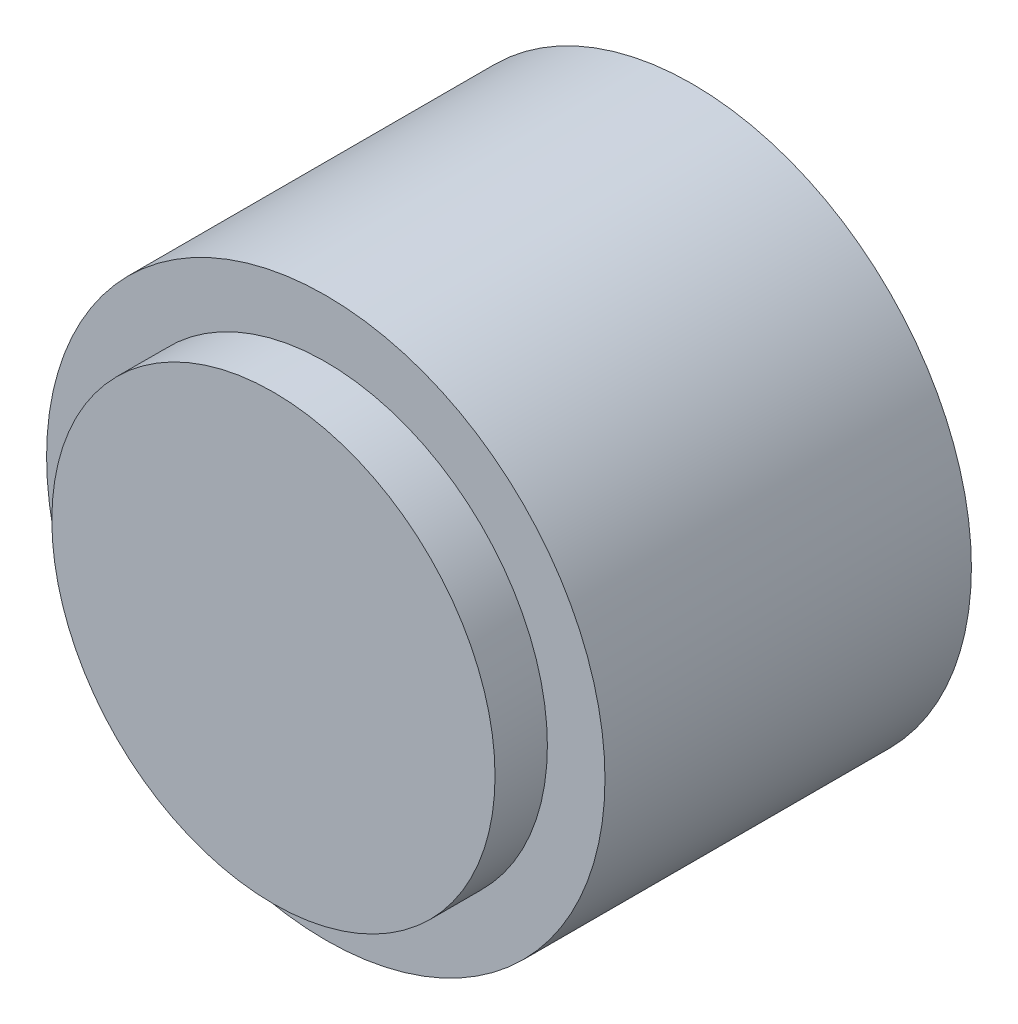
ISO-10303-21;
HEADER;
FILE_DESCRIPTION(('STEP AP214'),'2;1');
FILE_NAME('part.step','',(''),(''),'','','');
FILE_SCHEMA(('AUTOMOTIVE_DESIGN { 1 0 10303 214 1 1 1 1 }'));
ENDSEC;
DATA;
#1=APPLICATION_CONTEXT('core data for automotive mechanical design processes');
#2=APPLICATION_PROTOCOL_DEFINITION('international standard','automotive_design',2000,#1);
#3=PRODUCT_CONTEXT('',#1,'mechanical');
#4=PRODUCT('Part','Part','',(#3));
#5=PRODUCT_RELATED_PRODUCT_CATEGORY('part','',(#4));
#6=PRODUCT_DEFINITION_FORMATION('','',#4);
#7=PRODUCT_DEFINITION_CONTEXT('part definition',#1,'design');
#8=PRODUCT_DEFINITION('design','',#6,#7);
#9=PRODUCT_DEFINITION_SHAPE('','',#8);
#10=(LENGTH_UNIT() NAMED_UNIT(*) SI_UNIT(.MILLI.,.METRE.));
#11=(NAMED_UNIT(*) PLANE_ANGLE_UNIT() SI_UNIT($,.RADIAN.));
#12=(NAMED_UNIT(*) SI_UNIT($,.STERADIAN.) SOLID_ANGLE_UNIT());
#13=UNCERTAINTY_MEASURE_WITH_UNIT(LENGTH_MEASURE(1.E-05),#10,'distance_accuracy_value','');
#14=(GEOMETRIC_REPRESENTATION_CONTEXT(3) GLOBAL_UNCERTAINTY_ASSIGNED_CONTEXT((#13)) GLOBAL_UNIT_ASSIGNED_CONTEXT((#10,
#11,#12)) REPRESENTATION_CONTEXT('',''));
#15=CARTESIAN_POINT('',(0.,0.,0.));
#16=DIRECTION('',(0.,0.,1.));
#17=DIRECTION('',(1.,0.,0.));
#18=AXIS2_PLACEMENT_3D('',#15,#16,#17);
#19=CARTESIAN_POINT('',(0.,0.,32.));
#20=DIRECTION('',(0.,0.,1.));
#21=DIRECTION('',(1.,0.,0.));
#22=AXIS2_PLACEMENT_3D('',#19,#20,#21);
#23=CYLINDRICAL_SURFACE('',#22,8.);
#24=CARTESIAN_POINT('',(0.,0.,0.));
#25=DIRECTION('',(0.,0.,1.));
#26=DIRECTION('',(1.,0.,0.));
#27=AXIS2_PLACEMENT_3D('',#24,#25,#26);
#28=CIRCLE('',#27,8.);
#29=CARTESIAN_POINT('',(8.,0.,0.));
#30=VERTEX_POINT('',#29);
#31=EDGE_CURVE('E8',#30,#30,#28,.T.);
#32=ORIENTED_EDGE('',*,*,#31,.T.);
#33=EDGE_LOOP('',(#32));
#34=FACE_BOUND('',#33,.T.);
#35=CARTESIAN_POINT('',(0.,0.,10.5));
#36=DIRECTION('',(0.,0.,1.));
#37=DIRECTION('',(1.,0.,0.));
#38=AXIS2_PLACEMENT_3D('',#35,#36,#37);
#39=CIRCLE('',#38,8.);
#40=CARTESIAN_POINT('',(8.,0.,10.5));
#41=VERTEX_POINT('',#40);
#42=EDGE_CURVE('E29',#41,#41,#39,.T.);
#43=ORIENTED_EDGE('',*,*,#42,.F.);
#44=EDGE_LOOP('',(#43));
#45=FACE_BOUND('',#44,.T.);
#46=ADVANCED_FACE('F13',(#34,#45),#23,.T.);
#47=CARTESIAN_POINT('',(3.,0.,0.));
#48=DIRECTION('',(0.,0.,1.));
#49=DIRECTION('',(1.,0.,0.));
#50=AXIS2_PLACEMENT_3D('',#47,#48,#49);
#51=PLANE('',#50);
#52=ORIENTED_EDGE('',*,*,#31,.F.);
#53=EDGE_LOOP('',(#52));
#54=FACE_BOUND('',#53,.T.);
#55=CARTESIAN_POINT('',(0.,0.,0.));
#56=DIRECTION('',(0.,0.,1.));
#57=DIRECTION('',(1.,0.,0.));
#58=AXIS2_PLACEMENT_3D('',#55,#56,#57);
#59=CIRCLE('',#58,3.);
#60=CARTESIAN_POINT('',(3.,0.,0.));
#61=VERTEX_POINT('',#60);
#62=EDGE_CURVE('E20',#61,#61,#59,.T.);
#63=ORIENTED_EDGE('',*,*,#62,.T.);
#64=EDGE_LOOP('',(#63));
#65=FACE_BOUND('',#64,.T.);
#66=ADVANCED_FACE('F42',(#54,#65),#51,.F.);
#67=CARTESIAN_POINT('',(0.,0.,32.));
#68=DIRECTION('',(0.,0.,1.));
#69=DIRECTION('',(1.,0.,0.));
#70=AXIS2_PLACEMENT_3D('',#67,#68,#69);
#71=CYLINDRICAL_SURFACE('',#70,3.);
#72=CARTESIAN_POINT('',(0.,0.,7.8));
#73=DIRECTION('',(0.,0.,-1.));
#74=DIRECTION('',(-1.,0.,0.));
#75=AXIS2_PLACEMENT_3D('',#72,#73,#74);
#76=CIRCLE('',#75,3.);
#77=CARTESIAN_POINT('',(-3.,0.,7.8));
#78=VERTEX_POINT('',#77);
#79=EDGE_CURVE('E32',#78,#78,#76,.T.);
#80=ORIENTED_EDGE('',*,*,#79,.F.);
#81=EDGE_LOOP('',(#80));
#82=FACE_BOUND('',#81,.T.);
#83=ORIENTED_EDGE('',*,*,#62,.F.);
#84=EDGE_LOOP('',(#83));
#85=FACE_BOUND('',#84,.T.);
#86=ADVANCED_FACE('F38',(#82,#85),#71,.F.);
#87=CARTESIAN_POINT('',(0.,0.,20.));
#88=DIRECTION('',(0.,0.,1.));
#89=DIRECTION('',(1.,0.,0.));
#90=AXIS2_PLACEMENT_3D('',#87,#88,#89);
#91=CYLINDRICAL_SURFACE('',#90,6.35);
#92=CARTESIAN_POINT('',(0.,0.,10.5));
#93=DIRECTION('',(0.,0.,1.));
#94=DIRECTION('',(1.,0.,0.));
#95=AXIS2_PLACEMENT_3D('',#92,#93,#94);
#96=CIRCLE('',#95,6.35);
#97=CARTESIAN_POINT('',(6.35,0.,10.5));
#98=VERTEX_POINT('',#97);
#99=EDGE_CURVE('E26',#98,#98,#96,.T.);
#100=ORIENTED_EDGE('',*,*,#99,.T.);
#101=EDGE_LOOP('',(#100));
#102=FACE_BOUND('',#101,.T.);
#103=CARTESIAN_POINT('',(0.,0.,12.));
#104=DIRECTION('',(0.,0.,-1.));
#105=DIRECTION('',(-1.,0.,0.));
#106=AXIS2_PLACEMENT_3D('',#103,#104,#105);
#107=CIRCLE('',#106,6.35);
#108=CARTESIAN_POINT('',(-6.35,0.,12.));
#109=VERTEX_POINT('',#108);
#110=EDGE_CURVE('E16',#109,#109,#107,.T.);
#111=ORIENTED_EDGE('',*,*,#110,.T.);
#112=EDGE_LOOP('',(#111));
#113=FACE_BOUND('',#112,.T.);
#114=ADVANCED_FACE('F41',(#102,#113),#91,.T.);
#115=CARTESIAN_POINT('',(-6.35,0.,10.5));
#116=DIRECTION('',(0.,0.,1.));
#117=DIRECTION('',(1.,0.,0.));
#118=AXIS2_PLACEMENT_3D('',#115,#116,#117);
#119=PLANE('',#118);
#120=ORIENTED_EDGE('',*,*,#42,.T.);
#121=EDGE_LOOP('',(#120));
#122=FACE_BOUND('',#121,.T.);
#123=ORIENTED_EDGE('',*,*,#99,.F.);
#124=EDGE_LOOP('',(#123));
#125=FACE_BOUND('',#124,.T.);
#126=ADVANCED_FACE('F57',(#122,#125),#119,.T.);
#127=CARTESIAN_POINT('',(8.,0.,12.));
#128=DIRECTION('',(0.,0.,-1.));
#129=DIRECTION('',(-1.,0.,0.));
#130=AXIS2_PLACEMENT_3D('',#127,#128,#129);
#131=PLANE('',#130);
#132=ORIENTED_EDGE('',*,*,#110,.F.);
#133=EDGE_LOOP('',(#132));
#134=FACE_BOUND('',#133,.T.);
#135=ADVANCED_FACE('F54',(#134),#131,.F.);
#136=CARTESIAN_POINT('',(0.,0.,7.8));
#137=DIRECTION('',(0.,0.,-1.));
#138=DIRECTION('',(-1.,0.,0.));
#139=AXIS2_PLACEMENT_3D('',#136,#137,#138);
#140=PLANE('',#139);
#141=ORIENTED_EDGE('',*,*,#79,.T.);
#142=EDGE_LOOP('',(#141));
#143=FACE_BOUND('',#142,.T.);
#144=ADVANCED_FACE('F36',(#143),#140,.T.);
#145=CLOSED_SHELL('',(#46,#66,#86,#114,#126,#135,#144));
#146=MANIFOLD_SOLID_BREP('B1',#145);
#147=ADVANCED_BREP_SHAPE_REPRESENTATION('',(#18,#146),#14);
#148=SHAPE_DEFINITION_REPRESENTATION(#9,#147);
ENDSEC;
END-ISO-10303-21;
